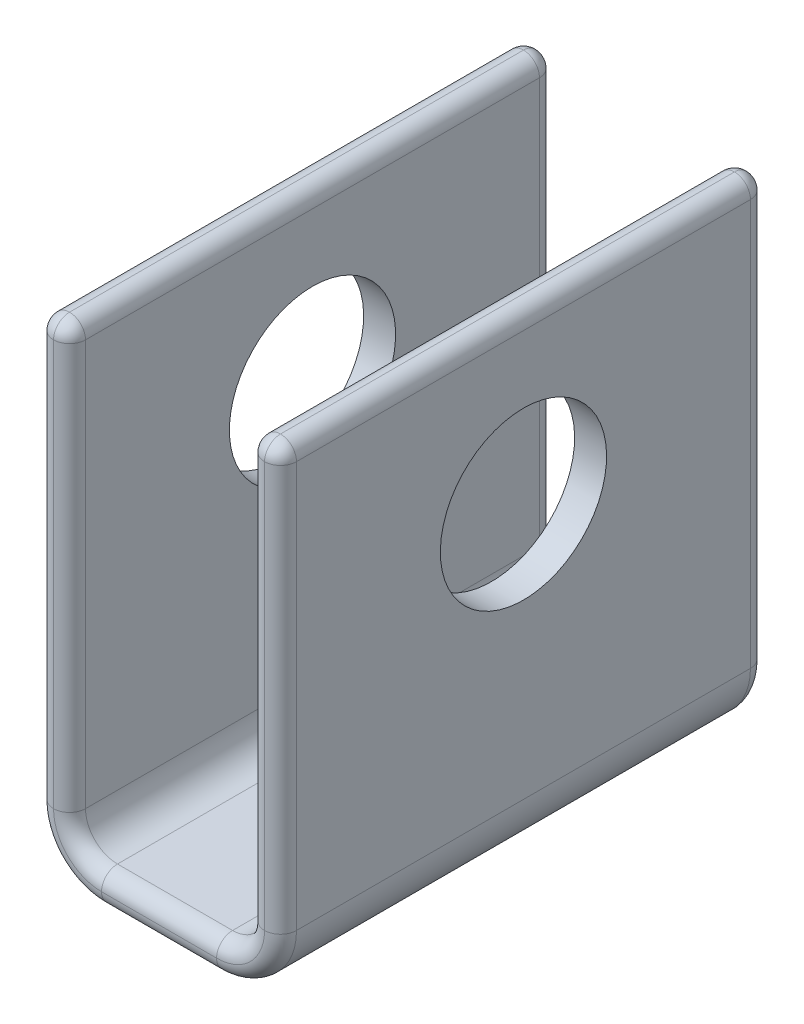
ISO-10303-21;
HEADER;
FILE_DESCRIPTION(('STEP AP214'),'2;1');
FILE_NAME('part.step','',(''),(''),'','','');
FILE_SCHEMA(('AUTOMOTIVE_DESIGN { 1 0 10303 214 1 1 1 1 }'));
ENDSEC;
DATA;
#1=APPLICATION_CONTEXT('core data for automotive mechanical design processes');
#2=APPLICATION_PROTOCOL_DEFINITION('international standard','automotive_design',2000,#1);
#3=PRODUCT_CONTEXT('',#1,'mechanical');
#4=PRODUCT('Part','Part','',(#3));
#5=PRODUCT_RELATED_PRODUCT_CATEGORY('part','',(#4));
#6=PRODUCT_DEFINITION_FORMATION('','',#4);
#7=PRODUCT_DEFINITION_CONTEXT('part definition',#1,'design');
#8=PRODUCT_DEFINITION('design','',#6,#7);
#9=PRODUCT_DEFINITION_SHAPE('','',#8);
#10=(LENGTH_UNIT() NAMED_UNIT(*) SI_UNIT(.MILLI.,.METRE.));
#11=(NAMED_UNIT(*) PLANE_ANGLE_UNIT() SI_UNIT($,.RADIAN.));
#12=(NAMED_UNIT(*) SI_UNIT($,.STERADIAN.) SOLID_ANGLE_UNIT());
#13=UNCERTAINTY_MEASURE_WITH_UNIT(LENGTH_MEASURE(1.E-05),#10,'distance_accuracy_value','');
#14=(GEOMETRIC_REPRESENTATION_CONTEXT(3) GLOBAL_UNCERTAINTY_ASSIGNED_CONTEXT((#13)) GLOBAL_UNIT_ASSIGNED_CONTEXT((#10,
#11,#12)) REPRESENTATION_CONTEXT('',''));
#15=CARTESIAN_POINT('',(0.,0.,0.));
#16=DIRECTION('',(0.,0.,1.));
#17=DIRECTION('',(1.,0.,0.));
#18=AXIS2_PLACEMENT_3D('',#15,#16,#17);
#19=CARTESIAN_POINT('',(-7.,5.,19.));
#20=DIRECTION('',(-1.,0.,0.));
#21=DIRECTION('',(0.,-1.,0.));
#22=AXIS2_PLACEMENT_3D('',#19,#20,#21);
#23=PLANE('',#22);
#24=CARTESIAN_POINT('',(-7.,25.,0.));
#25=DIRECTION('',(-1.,0.,0.));
#26=DIRECTION('',(0.,-1.,0.));
#27=AXIS2_PLACEMENT_3D('',#24,#25,#26);
#28=CIRCLE('',#27,6.5);
#29=CARTESIAN_POINT('',(-7.,18.5,0.));
#30=VERTEX_POINT('',#29);
#31=EDGE_CURVE('E271',#30,#30,#28,.T.);
#32=ORIENTED_EDGE('',*,*,#31,.T.);
#33=EDGE_LOOP('',(#32));
#34=FACE_BOUND('',#33,.T.);
#35=DIRECTION('',(0.,0.,-1.));
#36=VECTOR('',#35,1.);
#37=CARTESIAN_POINT('',(-7.,5.,19.));
#38=LINE('',#37,#36);
#39=CARTESIAN_POINT('',(-7.,5.,17.75));
#40=VERTEX_POINT('',#39);
#41=CARTESIAN_POINT('',(-7.,5.,-17.75));
#42=VERTEX_POINT('',#41);
#43=EDGE_CURVE('E258',#40,#42,#38,.T.);
#44=ORIENTED_EDGE('',*,*,#43,.T.);
#45=DIRECTION('',(0.,1.,0.));
#46=VECTOR('',#45,1.);
#47=CARTESIAN_POINT('',(-7.,38.,-17.75));
#48=LINE('',#47,#46);
#49=CARTESIAN_POINT('',(-7.,36.75,-17.75));
#50=VERTEX_POINT('',#49);
#51=EDGE_CURVE('E308',#42,#50,#48,.T.);
#52=ORIENTED_EDGE('',*,*,#51,.T.);
#53=DIRECTION('',(0.,0.,-1.));
#54=VECTOR('',#53,1.);
#55=CARTESIAN_POINT('',(-7.,36.75,19.));
#56=LINE('',#55,#54);
#57=CARTESIAN_POINT('',(-7.,36.75,17.75));
#58=VERTEX_POINT('',#57);
#59=EDGE_CURVE('E302',#50,#58,#56,.F.);
#60=ORIENTED_EDGE('',*,*,#59,.T.);
#61=DIRECTION('',(0.,1.,0.));
#62=VECTOR('',#61,1.);
#63=CARTESIAN_POINT('',(-7.,5.,17.75));
#64=LINE('',#63,#62);
#65=EDGE_CURVE('E305',#58,#40,#64,.F.);
#66=ORIENTED_EDGE('',*,*,#65,.T.);
#67=EDGE_LOOP('',(#44,#52,#60,#66));
#68=FACE_BOUND('',#67,.T.);
#69=ADVANCED_FACE('F39',(#34,#68),#23,.F.);
#70=CARTESIAN_POINT('',(-9.5,5.,19.));
#71=DIRECTION('',(-1.,0.,0.));
#72=DIRECTION('',(0.,-1.,0.));
#73=AXIS2_PLACEMENT_3D('',#70,#71,#72);
#74=PLANE('',#73);
#75=CARTESIAN_POINT('',(-9.50000000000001,25.,0.));
#76=DIRECTION('',(1.,0.,0.));
#77=DIRECTION('',(0.,1.,0.));
#78=AXIS2_PLACEMENT_3D('',#75,#76,#77);
#79=CIRCLE('',#78,6.5);
#80=CARTESIAN_POINT('',(-9.50000000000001,31.5,0.));
#81=VERTEX_POINT('',#80);
#82=EDGE_CURVE('E969',#81,#81,#79,.T.);
#83=ORIENTED_EDGE('',*,*,#82,.T.);
#84=EDGE_LOOP('',(#83));
#85=FACE_BOUND('',#84,.T.);
#86=DIRECTION('',(0.,0.,-1.));
#87=VECTOR('',#86,1.);
#88=CARTESIAN_POINT('',(-9.5,36.75,19.));
#89=LINE('',#88,#87);
#90=CARTESIAN_POINT('',(-9.5,36.75,17.75));
#91=VERTEX_POINT('',#90);
#92=CARTESIAN_POINT('',(-9.5,36.75,-17.75));
#93=VERTEX_POINT('',#92);
#94=EDGE_CURVE('E311',#91,#93,#89,.T.);
#95=ORIENTED_EDGE('',*,*,#94,.T.);
#96=DIRECTION('',(0.,1.,0.));
#97=VECTOR('',#96,1.);
#98=CARTESIAN_POINT('',(-9.5,5.,-17.75));
#99=LINE('',#98,#97);
#100=CARTESIAN_POINT('',(-9.5,5.,-17.75));
#101=VERTEX_POINT('',#100);
#102=EDGE_CURVE('E317',#93,#101,#99,.F.);
#103=ORIENTED_EDGE('',*,*,#102,.T.);
#104=DIRECTION('',(0.,0.,-1.));
#105=VECTOR('',#104,1.);
#106=CARTESIAN_POINT('',(-9.5,5.,19.));
#107=LINE('',#106,#105);
#108=CARTESIAN_POINT('',(-9.5,5.,17.75));
#109=VERTEX_POINT('',#108);
#110=EDGE_CURVE('E288',#109,#101,#107,.T.);
#111=ORIENTED_EDGE('',*,*,#110,.F.);
#112=DIRECTION('',(0.,1.,0.));
#113=VECTOR('',#112,1.);
#114=CARTESIAN_POINT('',(-9.5,38.,17.75));
#115=LINE('',#114,#113);
#116=EDGE_CURVE('E314',#109,#91,#115,.T.);
#117=ORIENTED_EDGE('',*,*,#116,.T.);
#118=EDGE_LOOP('',(#95,#103,#111,#117));
#119=FACE_BOUND('',#118,.T.);
#120=ADVANCED_FACE('F577',(#85,#119),#74,.T.);
#121=CARTESIAN_POINT('',(-4.5,5.,19.));
#122=DIRECTION('',(0.,0.,-1.));
#123=DIRECTION('',(-1.,0.,0.));
#124=AXIS2_PLACEMENT_3D('',#121,#122,#123);
#125=CYLINDRICAL_SURFACE('',#124,5.);
#126=ORIENTED_EDGE('',*,*,#110,.T.);
#127=CARTESIAN_POINT('',(-4.5,5.,-17.75));
#128=DIRECTION('',(0.,0.,-1.));
#129=DIRECTION('',(-1.,0.,0.));
#130=AXIS2_PLACEMENT_3D('',#127,#128,#129);
#131=CIRCLE('',#130,5.);
#132=CARTESIAN_POINT('',(-4.5,0.,-17.75));
#133=VERTEX_POINT('',#132);
#134=EDGE_CURVE('E323',#101,#133,#131,.F.);
#135=ORIENTED_EDGE('',*,*,#134,.T.);
#136=DIRECTION('',(0.,0.,-1.));
#137=VECTOR('',#136,1.);
#138=CARTESIAN_POINT('',(-4.5,0.,19.));
#139=LINE('',#138,#137);
#140=CARTESIAN_POINT('',(-4.5,0.,17.75));
#141=VERTEX_POINT('',#140);
#142=EDGE_CURVE('E284',#141,#133,#139,.T.);
#143=ORIENTED_EDGE('',*,*,#142,.F.);
#144=CARTESIAN_POINT('',(-4.5,5.,17.75));
#145=DIRECTION('',(0.,0.,-1.));
#146=DIRECTION('',(-1.,0.,0.));
#147=AXIS2_PLACEMENT_3D('',#144,#145,#146);
#148=CIRCLE('',#147,5.);
#149=EDGE_CURVE('E320',#141,#109,#148,.T.);
#150=ORIENTED_EDGE('',*,*,#149,.T.);
#151=EDGE_LOOP('',(#126,#135,#143,#150));
#152=FACE_BOUND('',#151,.T.);
#153=ADVANCED_FACE('F574',(#152),#125,.T.);
#154=CARTESIAN_POINT('',(-4.5,0.,19.));
#155=DIRECTION('',(0.,-1.,0.));
#156=DIRECTION('',(1.,0.,0.));
#157=AXIS2_PLACEMENT_3D('',#154,#155,#156);
#158=PLANE('',#157);
#159=ORIENTED_EDGE('',*,*,#142,.T.);
#160=DIRECTION('',(-1.,0.,0.));
#161=VECTOR('',#160,1.);
#162=CARTESIAN_POINT('',(-4.5,0.,-17.75));
#163=LINE('',#162,#161);
#164=CARTESIAN_POINT('',(4.5,0.,-17.75));
#165=VERTEX_POINT('',#164);
#166=EDGE_CURVE('E329',#133,#165,#163,.F.);
#167=ORIENTED_EDGE('',*,*,#166,.T.);
#168=DIRECTION('',(0.,0.,-1.));
#169=VECTOR('',#168,1.);
#170=CARTESIAN_POINT('',(4.5,0.,19.));
#171=LINE('',#170,#169);
#172=CARTESIAN_POINT('',(4.5,0.,17.75));
#173=VERTEX_POINT('',#172);
#174=EDGE_CURVE('E280',#173,#165,#171,.T.);
#175=ORIENTED_EDGE('',*,*,#174,.F.);
#176=DIRECTION('',(-1.,0.,0.));
#177=VECTOR('',#176,1.);
#178=CARTESIAN_POINT('',(-4.5,0.,17.75));
#179=LINE('',#178,#177);
#180=EDGE_CURVE('E326',#173,#141,#179,.T.);
#181=ORIENTED_EDGE('',*,*,#180,.T.);
#182=EDGE_LOOP('',(#159,#167,#175,#181));
#183=FACE_BOUND('',#182,.T.);
#184=ADVANCED_FACE('F564',(#183),#158,.T.);
#185=CARTESIAN_POINT('',(4.5,5.,19.));
#186=DIRECTION('',(0.,0.,-1.));
#187=DIRECTION('',(-1.,0.,0.));
#188=AXIS2_PLACEMENT_3D('',#185,#186,#187);
#189=CYLINDRICAL_SURFACE('',#188,5.);
#190=ORIENTED_EDGE('',*,*,#174,.T.);
#191=CARTESIAN_POINT('',(4.5,5.,-17.75));
#192=DIRECTION('',(0.,0.,-1.));
#193=DIRECTION('',(-1.,0.,0.));
#194=AXIS2_PLACEMENT_3D('',#191,#192,#193);
#195=CIRCLE('',#194,5.);
#196=CARTESIAN_POINT('',(9.49999999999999,5.,-17.75));
#197=VERTEX_POINT('',#196);
#198=EDGE_CURVE('E335',#165,#197,#195,.F.);
#199=ORIENTED_EDGE('',*,*,#198,.T.);
#200=DIRECTION('',(0.,0.,-1.));
#201=VECTOR('',#200,1.);
#202=CARTESIAN_POINT('',(9.49999999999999,5.,19.));
#203=LINE('',#202,#201);
#204=CARTESIAN_POINT('',(9.49999999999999,5.,17.75));
#205=VERTEX_POINT('',#204);
#206=EDGE_CURVE('E276',#205,#197,#203,.T.);
#207=ORIENTED_EDGE('',*,*,#206,.F.);
#208=CARTESIAN_POINT('',(4.5,5.,17.75));
#209=DIRECTION('',(0.,0.,-1.));
#210=DIRECTION('',(-1.,0.,0.));
#211=AXIS2_PLACEMENT_3D('',#208,#209,#210);
#212=CIRCLE('',#211,5.);
#213=EDGE_CURVE('E332',#205,#173,#212,.T.);
#214=ORIENTED_EDGE('',*,*,#213,.T.);
#215=EDGE_LOOP('',(#190,#199,#207,#214));
#216=FACE_BOUND('',#215,.T.);
#217=ADVANCED_FACE('F548',(#216),#189,.T.);
#218=CARTESIAN_POINT('',(9.49999999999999,5.,19.));
#219=DIRECTION('',(1.,0.,0.));
#220=DIRECTION('',(0.,1.,0.));
#221=AXIS2_PLACEMENT_3D('',#218,#219,#220);
#222=PLANE('',#221);
#223=CARTESIAN_POINT('',(9.49999999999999,25.,0.));
#224=DIRECTION('',(1.,0.,0.));
#225=DIRECTION('',(0.,1.,0.));
#226=AXIS2_PLACEMENT_3D('',#223,#224,#225);
#227=CIRCLE('',#226,6.5);
#228=CARTESIAN_POINT('',(9.49999999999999,31.5,0.));
#229=VERTEX_POINT('',#228);
#230=EDGE_CURVE('E967',#229,#229,#227,.T.);
#231=ORIENTED_EDGE('',*,*,#230,.F.);
#232=EDGE_LOOP('',(#231));
#233=FACE_BOUND('',#232,.T.);
#234=DIRECTION('',(0.,0.,-1.));
#235=VECTOR('',#234,1.);
#236=CARTESIAN_POINT('',(9.49999999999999,36.75,19.));
#237=LINE('',#236,#235);
#238=CARTESIAN_POINT('',(9.49999999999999,36.75,-17.75));
#239=VERTEX_POINT('',#238);
#240=CARTESIAN_POINT('',(9.49999999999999,36.75,17.75));
#241=VERTEX_POINT('',#240);
#242=EDGE_CURVE('E295',#239,#241,#237,.F.);
#243=ORIENTED_EDGE('',*,*,#242,.T.);
#244=DIRECTION('',(0.,-1.,0.));
#245=VECTOR('',#244,1.);
#246=CARTESIAN_POINT('',(9.49999999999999,5.,17.75));
#247=LINE('',#246,#245);
#248=EDGE_CURVE('E298',#241,#205,#247,.T.);
#249=ORIENTED_EDGE('',*,*,#248,.T.);
#250=ORIENTED_EDGE('',*,*,#206,.T.);
#251=DIRECTION('',(0.,-1.,0.));
#252=VECTOR('',#251,1.);
#253=CARTESIAN_POINT('',(9.49999999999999,5.,-17.75));
#254=LINE('',#253,#252);
#255=EDGE_CURVE('E292',#197,#239,#254,.F.);
#256=ORIENTED_EDGE('',*,*,#255,.T.);
#257=EDGE_LOOP('',(#243,#249,#250,#256));
#258=FACE_BOUND('',#257,.T.);
#259=ADVANCED_FACE('F551',(#233,#258),#222,.T.);
#260=CARTESIAN_POINT('',(6.99999999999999,5.,19.));
#261=DIRECTION('',(1.,0.,0.));
#262=DIRECTION('',(0.,1.,0.));
#263=AXIS2_PLACEMENT_3D('',#260,#261,#262);
#264=PLANE('',#263);
#265=CARTESIAN_POINT('',(6.99999999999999,25.,0.));
#266=DIRECTION('',(1.,0.,0.));
#267=DIRECTION('',(0.,1.,0.));
#268=AXIS2_PLACEMENT_3D('',#265,#266,#267);
#269=CIRCLE('',#268,6.5);
#270=CARTESIAN_POINT('',(6.99999999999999,31.5,0.));
#271=VERTEX_POINT('',#270);
#272=EDGE_CURVE('E43',#271,#271,#269,.T.);
#273=ORIENTED_EDGE('',*,*,#272,.T.);
#274=EDGE_LOOP('',(#273));
#275=FACE_BOUND('',#274,.T.);
#276=DIRECTION('',(0.,0.,-1.));
#277=VECTOR('',#276,1.);
#278=CARTESIAN_POINT('',(6.99999999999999,36.75,-19.));
#279=LINE('',#278,#277);
#280=CARTESIAN_POINT('',(6.99999999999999,36.75,17.75));
#281=VERTEX_POINT('',#280);
#282=CARTESIAN_POINT('',(6.99999999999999,36.75,-17.75));
#283=VERTEX_POINT('',#282);
#284=EDGE_CURVE('E338',#281,#283,#279,.T.);
#285=ORIENTED_EDGE('',*,*,#284,.T.);
#286=DIRECTION('',(0.,-1.,0.));
#287=VECTOR('',#286,1.);
#288=CARTESIAN_POINT('',(6.99999999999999,5.,-17.75));
#289=LINE('',#288,#287);
#290=CARTESIAN_POINT('',(6.99999999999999,5.,-17.75));
#291=VERTEX_POINT('',#290);
#292=EDGE_CURVE('E344',#283,#291,#289,.T.);
#293=ORIENTED_EDGE('',*,*,#292,.T.);
#294=DIRECTION('',(0.,0.,-1.));
#295=VECTOR('',#294,1.);
#296=CARTESIAN_POINT('',(6.99999999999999,5.,19.));
#297=LINE('',#296,#295);
#298=CARTESIAN_POINT('',(6.99999999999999,5.,17.75));
#299=VERTEX_POINT('',#298);
#300=EDGE_CURVE('E196',#299,#291,#297,.T.);
#301=ORIENTED_EDGE('',*,*,#300,.F.);
#302=DIRECTION('',(0.,-1.,0.));
#303=VECTOR('',#302,1.);
#304=CARTESIAN_POINT('',(6.99999999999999,5.,17.75));
#305=LINE('',#304,#303);
#306=EDGE_CURVE('E341',#299,#281,#305,.F.);
#307=ORIENTED_EDGE('',*,*,#306,.T.);
#308=EDGE_LOOP('',(#285,#293,#301,#307));
#309=FACE_BOUND('',#308,.T.);
#310=ADVANCED_FACE('F518',(#275,#309),#264,.F.);
#311=CARTESIAN_POINT('',(4.5,5.,19.));
#312=DIRECTION('',(0.,0.,-1.));
#313=DIRECTION('',(-1.,0.,0.));
#314=AXIS2_PLACEMENT_3D('',#311,#312,#313);
#315=CYLINDRICAL_SURFACE('',#314,2.5);
#316=ORIENTED_EDGE('',*,*,#300,.T.);
#317=CARTESIAN_POINT('',(4.5,5.,-17.75));
#318=DIRECTION('',(0.,0.,-1.));
#319=DIRECTION('',(-1.,0.,0.));
#320=AXIS2_PLACEMENT_3D('',#317,#318,#319);
#321=CIRCLE('',#320,2.5);
#322=CARTESIAN_POINT('',(4.5,2.5,-17.75));
#323=VERTEX_POINT('',#322);
#324=EDGE_CURVE('E191',#291,#323,#321,.T.);
#325=ORIENTED_EDGE('',*,*,#324,.T.);
#326=DIRECTION('',(0.,0.,-1.));
#327=VECTOR('',#326,1.);
#328=CARTESIAN_POINT('',(4.5,2.5,19.));
#329=LINE('',#328,#327);
#330=CARTESIAN_POINT('',(4.5,2.5,17.75));
#331=VERTEX_POINT('',#330);
#332=EDGE_CURVE('E193',#331,#323,#329,.T.);
#333=ORIENTED_EDGE('',*,*,#332,.F.);
#334=CARTESIAN_POINT('',(4.5,5.,17.75));
#335=DIRECTION('',(0.,0.,-1.));
#336=DIRECTION('',(-1.,0.,0.));
#337=AXIS2_PLACEMENT_3D('',#334,#335,#336);
#338=CIRCLE('',#337,2.5);
#339=EDGE_CURVE('E202',#331,#299,#338,.F.);
#340=ORIENTED_EDGE('',*,*,#339,.T.);
#341=EDGE_LOOP('',(#316,#325,#333,#340));
#342=FACE_BOUND('',#341,.T.);
#343=ADVANCED_FACE('F192',(#342),#315,.F.);
#344=CARTESIAN_POINT('',(-4.5,2.5,19.));
#345=DIRECTION('',(0.,-1.,0.));
#346=DIRECTION('',(1.,0.,0.));
#347=AXIS2_PLACEMENT_3D('',#344,#345,#346);
#348=PLANE('',#347);
#349=ORIENTED_EDGE('',*,*,#332,.T.);
#350=DIRECTION('',(-1.,0.,0.));
#351=VECTOR('',#350,1.);
#352=CARTESIAN_POINT('',(-4.5,2.5,-17.75));
#353=LINE('',#352,#351);
#354=CARTESIAN_POINT('',(-4.5,2.5,-17.75));
#355=VERTEX_POINT('',#354);
#356=EDGE_CURVE('E59',#323,#355,#353,.T.);
#357=ORIENTED_EDGE('',*,*,#356,.T.);
#358=DIRECTION('',(0.,0.,-1.));
#359=VECTOR('',#358,1.);
#360=CARTESIAN_POINT('',(-4.5,2.5,19.));
#361=LINE('',#360,#359);
#362=CARTESIAN_POINT('',(-4.5,2.5,17.75));
#363=VERTEX_POINT('',#362);
#364=EDGE_CURVE('E207',#363,#355,#361,.T.);
#365=ORIENTED_EDGE('',*,*,#364,.F.);
#366=DIRECTION('',(-1.,0.,0.));
#367=VECTOR('',#366,1.);
#368=CARTESIAN_POINT('',(-4.5,2.5,17.75));
#369=LINE('',#368,#367);
#370=EDGE_CURVE('E201',#363,#331,#369,.F.);
#371=ORIENTED_EDGE('',*,*,#370,.T.);
#372=EDGE_LOOP('',(#349,#357,#365,#371));
#373=FACE_BOUND('',#372,.T.);
#374=ADVANCED_FACE('F204',(#373),#348,.F.);
#375=CARTESIAN_POINT('',(-4.5,5.,19.));
#376=DIRECTION('',(0.,0.,-1.));
#377=DIRECTION('',(-1.,0.,0.));
#378=AXIS2_PLACEMENT_3D('',#375,#376,#377);
#379=CYLINDRICAL_SURFACE('',#378,2.5);
#380=ORIENTED_EDGE('',*,*,#364,.T.);
#381=CARTESIAN_POINT('',(-4.5,5.,-17.75));
#382=DIRECTION('',(0.,0.,-1.));
#383=DIRECTION('',(-1.,0.,0.));
#384=AXIS2_PLACEMENT_3D('',#381,#382,#383);
#385=CIRCLE('',#384,2.5);
#386=EDGE_CURVE('E11',#355,#42,#385,.T.);
#387=ORIENTED_EDGE('',*,*,#386,.T.);
#388=ORIENTED_EDGE('',*,*,#43,.F.);
#389=CARTESIAN_POINT('',(-4.5,5.,17.75));
#390=DIRECTION('',(0.,0.,-1.));
#391=DIRECTION('',(-1.,0.,0.));
#392=AXIS2_PLACEMENT_3D('',#389,#390,#391);
#393=CIRCLE('',#392,2.5);
#394=EDGE_CURVE('E50',#40,#363,#393,.F.);
#395=ORIENTED_EDGE('',*,*,#394,.T.);
#396=EDGE_LOOP('',(#380,#387,#388,#395));
#397=FACE_BOUND('',#396,.T.);
#398=ADVANCED_FACE('F501',(#397),#379,.F.);
#399=CARTESIAN_POINT('',(-8.25,5.,-17.75));
#400=DIRECTION('',(0.,-1.,0.));
#401=DIRECTION('',(1.,0.,0.));
#402=AXIS2_PLACEMENT_3D('',#399,#400,#401);
#403=CYLINDRICAL_SURFACE('',#402,1.25);
#404=CARTESIAN_POINT('',(-8.25,36.75,-17.75));
#405=DIRECTION('',(0.,1.,0.));
#406=DIRECTION('',(0.,0.,1.));
#407=AXIS2_PLACEMENT_3D('',#404,#405,#406);
#408=CIRCLE('',#407,1.25);
#409=CARTESIAN_POINT('',(-8.25,36.75,-19.));
#410=VERTEX_POINT('',#409);
#411=EDGE_CURVE('E252',#50,#410,#408,.T.);
#412=ORIENTED_EDGE('',*,*,#411,.F.);
#413=ORIENTED_EDGE('',*,*,#51,.F.);
#414=CARTESIAN_POINT('',(-8.25,5.,-17.75));
#415=DIRECTION('',(0.,-1.,0.));
#416=DIRECTION('',(0.,0.,-1.));
#417=AXIS2_PLACEMENT_3D('',#414,#415,#416);
#418=CIRCLE('',#417,1.25);
#419=CARTESIAN_POINT('',(-8.25,5.,-19.));
#420=VERTEX_POINT('',#419);
#421=EDGE_CURVE('E113',#420,#42,#418,.T.);
#422=ORIENTED_EDGE('',*,*,#421,.F.);
#423=DIRECTION('',(0.,1.,0.));
#424=VECTOR('',#423,1.);
#425=CARTESIAN_POINT('',(-8.25,5.,-19.));
#426=LINE('',#425,#424);
#427=EDGE_CURVE('E117',#410,#420,#426,.F.);
#428=ORIENTED_EDGE('',*,*,#427,.F.);
#429=EDGE_LOOP('',(#412,#413,#422,#428));
#430=FACE_BOUND('',#429,.T.);
#431=ADVANCED_FACE('F41',(#430),#403,.T.);
#432=CARTESIAN_POINT('',(-4.5,5.,-17.75));
#433=DIRECTION('',(0.,0.,-1.));
#434=DIRECTION('',(-1.,0.,0.));
#435=AXIS2_PLACEMENT_3D('',#432,#433,#434);
#436=TOROIDAL_SURFACE('',#435,3.75,1.25);
#437=ORIENTED_EDGE('',*,*,#421,.T.);
#438=ORIENTED_EDGE('',*,*,#386,.F.);
#439=CARTESIAN_POINT('',(-4.5,1.25,-17.75));
#440=DIRECTION('',(1.,0.,0.));
#441=DIRECTION('',(0.,0.,-1.));
#442=AXIS2_PLACEMENT_3D('',#439,#440,#441);
#443=CIRCLE('',#442,1.25);
#444=CARTESIAN_POINT('',(-4.5,1.25,-19.));
#445=VERTEX_POINT('',#444);
#446=EDGE_CURVE('E215',#445,#355,#443,.T.);
#447=ORIENTED_EDGE('',*,*,#446,.F.);
#448=CARTESIAN_POINT('',(-4.5,5.,-19.));
#449=DIRECTION('',(0.,0.,-1.));
#450=DIRECTION('',(-1.,0.,0.));
#451=AXIS2_PLACEMENT_3D('',#448,#449,#450);
#452=CIRCLE('',#451,3.75);
#453=EDGE_CURVE('E246',#420,#445,#452,.F.);
#454=ORIENTED_EDGE('',*,*,#453,.F.);
#455=EDGE_LOOP('',(#437,#438,#447,#454));
#456=FACE_BOUND('',#455,.T.);
#457=ADVANCED_FACE('F499',(#456),#436,.T.);
#458=CARTESIAN_POINT('',(-8.25,5.,-17.75));
#459=DIRECTION('',(0.,1.,0.));
#460=DIRECTION('',(-1.,0.,0.));
#461=AXIS2_PLACEMENT_3D('',#458,#459,#460);
#462=CYLINDRICAL_SURFACE('',#461,1.25);
#463=CARTESIAN_POINT('',(-8.25,36.75,-17.75));
#464=DIRECTION('',(0.,1.,0.));
#465=DIRECTION('',(0.,0.,1.));
#466=AXIS2_PLACEMENT_3D('',#463,#464,#465);
#467=CIRCLE('',#466,1.25);
#468=EDGE_CURVE('E238',#410,#93,#467,.T.);
#469=ORIENTED_EDGE('',*,*,#468,.F.);
#470=ORIENTED_EDGE('',*,*,#427,.T.);
#471=CARTESIAN_POINT('',(-8.25,5.,-17.75));
#472=DIRECTION('',(0.,-1.,0.));
#473=DIRECTION('',(0.,0.,-1.));
#474=AXIS2_PLACEMENT_3D('',#471,#472,#473);
#475=CIRCLE('',#474,1.25);
#476=EDGE_CURVE('E242',#101,#420,#475,.T.);
#477=ORIENTED_EDGE('',*,*,#476,.F.);
#478=ORIENTED_EDGE('',*,*,#102,.F.);
#479=EDGE_LOOP('',(#469,#470,#477,#478));
#480=FACE_BOUND('',#479,.T.);
#481=ADVANCED_FACE('F602',(#480),#462,.T.);
#482=CARTESIAN_POINT('',(-8.25,36.75,-17.75));
#483=DIRECTION('',(0.,0.,1.));
#484=DIRECTION('',(1.,0.,0.));
#485=AXIS2_PLACEMENT_3D('',#482,#483,#484);
#486=SPHERICAL_SURFACE('',#485,1.25);
#487=ORIENTED_EDGE('',*,*,#411,.T.);
#488=CARTESIAN_POINT('',(-8.25,36.75,-17.75));
#489=DIRECTION('',(-1.,0.,0.));
#490=DIRECTION('',(0.,0.,1.));
#491=AXIS2_PLACEMENT_3D('',#488,#489,#490);
#492=CIRCLE('',#491,1.25);
#493=CARTESIAN_POINT('',(-8.25,38.,-17.75));
#494=VERTEX_POINT('',#493);
#495=EDGE_CURVE('E230',#494,#410,#492,.T.);
#496=ORIENTED_EDGE('',*,*,#495,.F.);
#497=CARTESIAN_POINT('',(-8.25,36.75,-17.75));
#498=DIRECTION('',(0.,0.,-1.));
#499=DIRECTION('',(-1.,0.,0.));
#500=AXIS2_PLACEMENT_3D('',#497,#498,#499);
#501=CIRCLE('',#500,1.25);
#502=EDGE_CURVE('E224',#50,#494,#501,.F.);
#503=ORIENTED_EDGE('',*,*,#502,.F.);
#504=EDGE_LOOP('',(#487,#496,#503));
#505=FACE_BOUND('',#504,.T.);
#506=ADVANCED_FACE('F603',(#505),#486,.T.);
#507=CARTESIAN_POINT('',(-4.5,1.25,-17.75));
#508=DIRECTION('',(1.,0.,0.));
#509=DIRECTION('',(0.,1.,0.));
#510=AXIS2_PLACEMENT_3D('',#507,#508,#509);
#511=CYLINDRICAL_SURFACE('',#510,1.25);
#512=ORIENTED_EDGE('',*,*,#446,.T.);
#513=ORIENTED_EDGE('',*,*,#356,.F.);
#514=CARTESIAN_POINT('',(4.49999999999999,1.25,-17.75));
#515=DIRECTION('',(1.,0.,0.));
#516=DIRECTION('',(0.,1.,0.));
#517=AXIS2_PLACEMENT_3D('',#514,#515,#516);
#518=CIRCLE('',#517,1.25);
#519=CARTESIAN_POINT('',(4.5,1.25,-19.));
#520=VERTEX_POINT('',#519);
#521=EDGE_CURVE('E213',#520,#323,#518,.T.);
#522=ORIENTED_EDGE('',*,*,#521,.F.);
#523=DIRECTION('',(-1.,0.,0.));
#524=VECTOR('',#523,1.);
#525=CARTESIAN_POINT('',(4.5,1.25,-19.));
#526=LINE('',#525,#524);
#527=EDGE_CURVE('E225',#445,#520,#526,.F.);
#528=ORIENTED_EDGE('',*,*,#527,.F.);
#529=EDGE_LOOP('',(#512,#513,#522,#528));
#530=FACE_BOUND('',#529,.T.);
#531=ADVANCED_FACE('F211',(#530),#511,.T.);
#532=CARTESIAN_POINT('',(-4.5,5.,-17.75));
#533=DIRECTION('',(0.,0.,-1.));
#534=DIRECTION('',(-1.,0.,0.));
#535=AXIS2_PLACEMENT_3D('',#532,#533,#534);
#536=TOROIDAL_SURFACE('',#535,3.75,1.25);
#537=ORIENTED_EDGE('',*,*,#476,.T.);
#538=ORIENTED_EDGE('',*,*,#453,.T.);
#539=CARTESIAN_POINT('',(-4.5,1.25,-17.75));
#540=DIRECTION('',(1.,0.,0.));
#541=DIRECTION('',(0.,0.,-1.));
#542=AXIS2_PLACEMENT_3D('',#539,#540,#541);
#543=CIRCLE('',#542,1.25);
#544=EDGE_CURVE('E232',#133,#445,#543,.T.);
#545=ORIENTED_EDGE('',*,*,#544,.F.);
#546=ORIENTED_EDGE('',*,*,#134,.F.);
#547=EDGE_LOOP('',(#537,#538,#545,#546));
#548=FACE_BOUND('',#547,.T.);
#549=ADVANCED_FACE('F497',(#548),#536,.T.);
#550=CARTESIAN_POINT('',(-8.25,36.75,-17.75));
#551=DIRECTION('',(0.,0.,1.));
#552=DIRECTION('',(1.,0.,0.));
#553=AXIS2_PLACEMENT_3D('',#550,#551,#552);
#554=SPHERICAL_SURFACE('',#553,1.25);
#555=ORIENTED_EDGE('',*,*,#495,.T.);
#556=ORIENTED_EDGE('',*,*,#468,.T.);
#557=CARTESIAN_POINT('',(-8.25,36.75,-17.75));
#558=DIRECTION('',(0.,0.,-1.));
#559=DIRECTION('',(-1.,0.,0.));
#560=AXIS2_PLACEMENT_3D('',#557,#558,#559);
#561=CIRCLE('',#560,1.25);
#562=EDGE_CURVE('E485',#494,#93,#561,.F.);
#563=ORIENTED_EDGE('',*,*,#562,.F.);
#564=EDGE_LOOP('',(#555,#556,#563));
#565=FACE_BOUND('',#564,.T.);
#566=ADVANCED_FACE('F599',(#565),#554,.T.);
#567=CARTESIAN_POINT('',(-8.25,36.75,19.));
#568=DIRECTION('',(0.,0.,1.));
#569=DIRECTION('',(1.,0.,0.));
#570=AXIS2_PLACEMENT_3D('',#567,#568,#569);
#571=CYLINDRICAL_SURFACE('',#570,1.25);
#572=ORIENTED_EDGE('',*,*,#59,.F.);
#573=ORIENTED_EDGE('',*,*,#502,.T.);
#574=DIRECTION('',(0.,0.,-1.));
#575=VECTOR('',#574,1.);
#576=CARTESIAN_POINT('',(-8.25,38.,-19.));
#577=LINE('',#576,#575);
#578=CARTESIAN_POINT('',(-8.25,38.,17.75));
#579=VERTEX_POINT('',#578);
#580=EDGE_CURVE('E481',#579,#494,#577,.T.);
#581=ORIENTED_EDGE('',*,*,#580,.F.);
#582=CARTESIAN_POINT('',(-8.25,36.75,17.75));
#583=DIRECTION('',(0.,0.,1.));
#584=DIRECTION('',(1.,0.,0.));
#585=AXIS2_PLACEMENT_3D('',#582,#583,#584);
#586=CIRCLE('',#585,1.25);
#587=EDGE_CURVE('E477',#58,#579,#586,.T.);
#588=ORIENTED_EDGE('',*,*,#587,.F.);
#589=EDGE_LOOP('',(#572,#573,#581,#588));
#590=FACE_BOUND('',#589,.T.);
#591=ADVANCED_FACE('F594',(#590),#571,.T.);
#592=CARTESIAN_POINT('',(4.5,5.,-17.75));
#593=DIRECTION('',(0.,0.,-1.));
#594=DIRECTION('',(-1.,0.,0.));
#595=AXIS2_PLACEMENT_3D('',#592,#593,#594);
#596=TOROIDAL_SURFACE('',#595,3.75,1.25);
#597=ORIENTED_EDGE('',*,*,#521,.T.);
#598=ORIENTED_EDGE('',*,*,#324,.F.);
#599=CARTESIAN_POINT('',(8.24999999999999,5.,-17.75));
#600=DIRECTION('',(0.,1.,0.));
#601=DIRECTION('',(0.,0.,1.));
#602=AXIS2_PLACEMENT_3D('',#599,#600,#601);
#603=CIRCLE('',#602,1.25);
#604=CARTESIAN_POINT('',(8.25,5.,-19.));
#605=VERTEX_POINT('',#604);
#606=EDGE_CURVE('E474',#605,#291,#603,.T.);
#607=ORIENTED_EDGE('',*,*,#606,.F.);
#608=CARTESIAN_POINT('',(4.5,5.,-19.));
#609=DIRECTION('',(0.,0.,-1.));
#610=DIRECTION('',(-1.,0.,0.));
#611=AXIS2_PLACEMENT_3D('',#608,#609,#610);
#612=CIRCLE('',#611,3.75);
#613=EDGE_CURVE('E221',#520,#605,#612,.F.);
#614=ORIENTED_EDGE('',*,*,#613,.F.);
#615=EDGE_LOOP('',(#597,#598,#607,#614));
#616=FACE_BOUND('',#615,.T.);
#617=ADVANCED_FACE('F219',(#616),#596,.T.);
#618=CARTESIAN_POINT('',(-4.5,1.25,-17.75));
#619=DIRECTION('',(-1.,0.,0.));
#620=DIRECTION('',(0.,-1.,0.));
#621=AXIS2_PLACEMENT_3D('',#618,#619,#620);
#622=CYLINDRICAL_SURFACE('',#621,1.25);
#623=ORIENTED_EDGE('',*,*,#544,.T.);
#624=ORIENTED_EDGE('',*,*,#527,.T.);
#625=CARTESIAN_POINT('',(4.5,1.25,-17.75));
#626=DIRECTION('',(1.,0.,0.));
#627=DIRECTION('',(0.,0.,-1.));
#628=AXIS2_PLACEMENT_3D('',#625,#626,#627);
#629=CIRCLE('',#628,1.25);
#630=EDGE_CURVE('E469',#165,#520,#629,.T.);
#631=ORIENTED_EDGE('',*,*,#630,.F.);
#632=ORIENTED_EDGE('',*,*,#166,.F.);
#633=EDGE_LOOP('',(#623,#624,#631,#632));
#634=FACE_BOUND('',#633,.T.);
#635=ADVANCED_FACE('F493',(#634),#622,.T.);
#636=CARTESIAN_POINT('',(-8.25,36.75,19.));
#637=DIRECTION('',(0.,0.,-1.));
#638=DIRECTION('',(-1.,0.,0.));
#639=AXIS2_PLACEMENT_3D('',#636,#637,#638);
#640=CYLINDRICAL_SURFACE('',#639,1.25);
#641=CARTESIAN_POINT('',(-8.25,36.75,17.75));
#642=DIRECTION('',(0.,0.,1.));
#643=DIRECTION('',(1.,0.,0.));
#644=AXIS2_PLACEMENT_3D('',#641,#642,#643);
#645=CIRCLE('',#644,1.25);
#646=EDGE_CURVE('E465',#579,#91,#645,.T.);
#647=ORIENTED_EDGE('',*,*,#646,.F.);
#648=ORIENTED_EDGE('',*,*,#580,.T.);
#649=ORIENTED_EDGE('',*,*,#562,.T.);
#650=ORIENTED_EDGE('',*,*,#94,.F.);
#651=EDGE_LOOP('',(#647,#648,#649,#650));
#652=FACE_BOUND('',#651,.T.);
#653=ADVANCED_FACE('F587',(#652),#640,.T.);
#654=CARTESIAN_POINT('',(-8.25,36.75,17.75));
#655=DIRECTION('',(0.,0.,1.));
#656=DIRECTION('',(1.,0.,0.));
#657=AXIS2_PLACEMENT_3D('',#654,#655,#656);
#658=SPHERICAL_SURFACE('',#657,1.25);
#659=ORIENTED_EDGE('',*,*,#587,.T.);
#660=CARTESIAN_POINT('',(-8.25,36.75,17.75));
#661=DIRECTION('',(-1.,0.,0.));
#662=DIRECTION('',(0.,0.,1.));
#663=AXIS2_PLACEMENT_3D('',#660,#661,#662);
#664=CIRCLE('',#663,1.25);
#665=CARTESIAN_POINT('',(-8.25,36.75,19.));
#666=VERTEX_POINT('',#665);
#667=EDGE_CURVE('E461',#666,#579,#664,.T.);
#668=ORIENTED_EDGE('',*,*,#667,.F.);
#669=CARTESIAN_POINT('',(-8.25,36.75,17.75));
#670=DIRECTION('',(0.,1.,0.));
#671=DIRECTION('',(0.,0.,1.));
#672=AXIS2_PLACEMENT_3D('',#669,#670,#671);
#673=CIRCLE('',#672,1.25);
#674=EDGE_CURVE('E457',#58,#666,#673,.F.);
#675=ORIENTED_EDGE('',*,*,#674,.F.);
#676=EDGE_LOOP('',(#659,#668,#675));
#677=FACE_BOUND('',#676,.T.);
#678=ADVANCED_FACE('F591',(#677),#658,.T.);
#679=CARTESIAN_POINT('',(8.24999999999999,5.,-17.75));
#680=DIRECTION('',(0.,1.,0.));
#681=DIRECTION('',(-1.,0.,0.));
#682=AXIS2_PLACEMENT_3D('',#679,#680,#681);
#683=CYLINDRICAL_SURFACE('',#682,1.25);
#684=ORIENTED_EDGE('',*,*,#606,.T.);
#685=ORIENTED_EDGE('',*,*,#292,.F.);
#686=CARTESIAN_POINT('',(8.24999999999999,36.75,-17.75));
#687=DIRECTION('',(0.,1.,0.));
#688=DIRECTION('',(0.,0.,1.));
#689=AXIS2_PLACEMENT_3D('',#686,#687,#688);
#690=CIRCLE('',#689,1.25);
#691=CARTESIAN_POINT('',(8.24999999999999,36.75,-19.));
#692=VERTEX_POINT('',#691);
#693=EDGE_CURVE('E453',#692,#283,#690,.T.);
#694=ORIENTED_EDGE('',*,*,#693,.F.);
#695=DIRECTION('',(0.,-1.,0.));
#696=VECTOR('',#695,1.);
#697=CARTESIAN_POINT('',(8.24999999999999,38.,-19.));
#698=LINE('',#697,#696);
#699=EDGE_CURVE('E445',#605,#692,#698,.F.);
#700=ORIENTED_EDGE('',*,*,#699,.F.);
#701=EDGE_LOOP('',(#684,#685,#694,#700));
#702=FACE_BOUND('',#701,.T.);
#703=ADVANCED_FACE('F522',(#702),#683,.T.);
#704=CARTESIAN_POINT('',(4.5,5.,-17.75));
#705=DIRECTION('',(0.,0.,-1.));
#706=DIRECTION('',(-1.,0.,0.));
#707=AXIS2_PLACEMENT_3D('',#704,#705,#706);
#708=TOROIDAL_SURFACE('',#707,3.75,1.25);
#709=ORIENTED_EDGE('',*,*,#630,.T.);
#710=ORIENTED_EDGE('',*,*,#613,.T.);
#711=CARTESIAN_POINT('',(8.24999999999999,5.,-17.75));
#712=DIRECTION('',(0.,1.,0.));
#713=DIRECTION('',(0.,0.,1.));
#714=AXIS2_PLACEMENT_3D('',#711,#712,#713);
#715=CIRCLE('',#714,1.25);
#716=EDGE_CURVE('E441',#197,#605,#715,.T.);
#717=ORIENTED_EDGE('',*,*,#716,.F.);
#718=ORIENTED_EDGE('',*,*,#198,.F.);
#719=EDGE_LOOP('',(#709,#710,#717,#718));
#720=FACE_BOUND('',#719,.T.);
#721=ADVANCED_FACE('F545',(#720),#708,.T.);
#722=CARTESIAN_POINT('',(-8.25,36.75,17.75));
#723=DIRECTION('',(0.,0.,1.));
#724=DIRECTION('',(1.,0.,0.));
#725=AXIS2_PLACEMENT_3D('',#722,#723,#724);
#726=SPHERICAL_SURFACE('',#725,1.25);
#727=ORIENTED_EDGE('',*,*,#667,.T.);
#728=ORIENTED_EDGE('',*,*,#646,.T.);
#729=CARTESIAN_POINT('',(-8.25,36.75,17.75));
#730=DIRECTION('',(0.,1.,0.));
#731=DIRECTION('',(0.,0.,1.));
#732=AXIS2_PLACEMENT_3D('',#729,#730,#731);
#733=CIRCLE('',#732,1.25);
#734=EDGE_CURVE('E437',#666,#91,#733,.F.);
#735=ORIENTED_EDGE('',*,*,#734,.F.);
#736=EDGE_LOOP('',(#727,#728,#735));
#737=FACE_BOUND('',#736,.T.);
#738=ADVANCED_FACE('F584',(#737),#726,.T.);
#739=CARTESIAN_POINT('',(-8.25,5.,17.75));
#740=DIRECTION('',(0.,1.,0.));
#741=DIRECTION('',(-1.,0.,0.));
#742=AXIS2_PLACEMENT_3D('',#739,#740,#741);
#743=CYLINDRICAL_SURFACE('',#742,1.25);
#744=ORIENTED_EDGE('',*,*,#65,.F.);
#745=ORIENTED_EDGE('',*,*,#674,.T.);
#746=DIRECTION('',(0.,1.,0.));
#747=VECTOR('',#746,1.);
#748=CARTESIAN_POINT('',(-8.25,5.,19.));
#749=LINE('',#748,#747);
#750=CARTESIAN_POINT('',(-8.25,5.,19.));
#751=VERTEX_POINT('',#750);
#752=EDGE_CURVE('E433',#751,#666,#749,.T.);
#753=ORIENTED_EDGE('',*,*,#752,.F.);
#754=CARTESIAN_POINT('',(-8.25,5.,17.75));
#755=DIRECTION('',(0.,-1.,0.));
#756=DIRECTION('',(0.,0.,-1.));
#757=AXIS2_PLACEMENT_3D('',#754,#755,#756);
#758=CIRCLE('',#757,1.25);
#759=EDGE_CURVE('E429',#40,#751,#758,.T.);
#760=ORIENTED_EDGE('',*,*,#759,.F.);
#761=EDGE_LOOP('',(#744,#745,#753,#760));
#762=FACE_BOUND('',#761,.T.);
#763=ADVANCED_FACE('F605',(#762),#743,.T.);
#764=CARTESIAN_POINT('',(8.24999999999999,36.75,-17.75));
#765=DIRECTION('',(0.,0.,1.));
#766=DIRECTION('',(1.,0.,0.));
#767=AXIS2_PLACEMENT_3D('',#764,#765,#766);
#768=SPHERICAL_SURFACE('',#767,1.25);
#769=CARTESIAN_POINT('',(8.24999999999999,36.75,-17.75));
#770=DIRECTION('',(-1.,0.,0.));
#771=DIRECTION('',(0.,0.,1.));
#772=AXIS2_PLACEMENT_3D('',#769,#770,#771);
#773=CIRCLE('',#772,1.25);
#774=CARTESIAN_POINT('',(8.24999999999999,38.,-17.75));
#775=VERTEX_POINT('',#774);
#776=EDGE_CURVE('E449',#692,#775,#773,.F.);
#777=ORIENTED_EDGE('',*,*,#776,.F.);
#778=ORIENTED_EDGE('',*,*,#693,.T.);
#779=CARTESIAN_POINT('',(8.24999999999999,36.75,-17.75));
#780=DIRECTION('',(0.,0.,-1.));
#781=DIRECTION('',(-1.,0.,0.));
#782=AXIS2_PLACEMENT_3D('',#779,#780,#781);
#783=CIRCLE('',#782,1.25);
#784=EDGE_CURVE('E425',#775,#283,#783,.F.);
#785=ORIENTED_EDGE('',*,*,#784,.F.);
#786=EDGE_LOOP('',(#777,#778,#785));
#787=FACE_BOUND('',#786,.T.);
#788=ADVANCED_FACE('F526',(#787),#768,.T.);
#789=CARTESIAN_POINT('',(8.25,5.,-17.75));
#790=DIRECTION('',(0.,-1.,0.));
#791=DIRECTION('',(1.,0.,0.));
#792=AXIS2_PLACEMENT_3D('',#789,#790,#791);
#793=CYLINDRICAL_SURFACE('',#792,1.25);
#794=ORIENTED_EDGE('',*,*,#716,.T.);
#795=ORIENTED_EDGE('',*,*,#699,.T.);
#796=CARTESIAN_POINT('',(8.24999999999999,36.75,-17.75));
#797=DIRECTION('',(0.,1.,0.));
#798=DIRECTION('',(0.,0.,1.));
#799=AXIS2_PLACEMENT_3D('',#796,#797,#798);
#800=CIRCLE('',#799,1.25);
#801=EDGE_CURVE('E421',#239,#692,#800,.T.);
#802=ORIENTED_EDGE('',*,*,#801,.F.);
#803=ORIENTED_EDGE('',*,*,#255,.F.);
#804=EDGE_LOOP('',(#794,#795,#802,#803));
#805=FACE_BOUND('',#804,.T.);
#806=ADVANCED_FACE('F541',(#805),#793,.T.);
#807=CARTESIAN_POINT('',(-8.25,5.,17.75));
#808=DIRECTION('',(0.,-1.,0.));
#809=DIRECTION('',(1.,0.,0.));
#810=AXIS2_PLACEMENT_3D('',#807,#808,#809);
#811=CYLINDRICAL_SURFACE('',#810,1.25);
#812=ORIENTED_EDGE('',*,*,#734,.T.);
#813=ORIENTED_EDGE('',*,*,#116,.F.);
#814=CARTESIAN_POINT('',(-8.25,5.,17.75));
#815=DIRECTION('',(0.,-1.,0.));
#816=DIRECTION('',(0.,0.,-1.));
#817=AXIS2_PLACEMENT_3D('',#814,#815,#816);
#818=CIRCLE('',#817,1.25);
#819=EDGE_CURVE('E417',#751,#109,#818,.T.);
#820=ORIENTED_EDGE('',*,*,#819,.F.);
#821=ORIENTED_EDGE('',*,*,#752,.T.);
#822=EDGE_LOOP('',(#812,#813,#820,#821));
#823=FACE_BOUND('',#822,.T.);
#824=ADVANCED_FACE('F581',(#823),#811,.T.);
#825=CARTESIAN_POINT('',(-4.5,5.,17.75));
#826=DIRECTION('',(0.,0.,-1.));
#827=DIRECTION('',(-1.,0.,0.));
#828=AXIS2_PLACEMENT_3D('',#825,#826,#827);
#829=TOROIDAL_SURFACE('',#828,3.75,1.25);
#830=ORIENTED_EDGE('',*,*,#394,.F.);
#831=ORIENTED_EDGE('',*,*,#759,.T.);
#832=CARTESIAN_POINT('',(-4.5,5.,19.));
#833=DIRECTION('',(0.,0.,-1.));
#834=DIRECTION('',(-1.,0.,0.));
#835=AXIS2_PLACEMENT_3D('',#832,#833,#834);
#836=CIRCLE('',#835,3.75);
#837=CARTESIAN_POINT('',(-4.5,1.25,19.));
#838=VERTEX_POINT('',#837);
#839=EDGE_CURVE('E413',#838,#751,#836,.T.);
#840=ORIENTED_EDGE('',*,*,#839,.F.);
#841=CARTESIAN_POINT('',(-4.5,1.25,17.75));
#842=DIRECTION('',(1.,0.,0.));
#843=DIRECTION('',(0.,1.,0.));
#844=AXIS2_PLACEMENT_3D('',#841,#842,#843);
#845=CIRCLE('',#844,1.25);
#846=EDGE_CURVE('E409',#363,#838,#845,.T.);
#847=ORIENTED_EDGE('',*,*,#846,.F.);
#848=EDGE_LOOP('',(#830,#831,#840,#847));
#849=FACE_BOUND('',#848,.T.);
#850=ADVANCED_FACE('F506',(#849),#829,.T.);
#851=CARTESIAN_POINT('',(8.24999999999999,36.75,19.));
#852=DIRECTION('',(0.,0.,1.));
#853=DIRECTION('',(1.,0.,0.));
#854=AXIS2_PLACEMENT_3D('',#851,#852,#853);
#855=CYLINDRICAL_SURFACE('',#854,1.25);
#856=ORIENTED_EDGE('',*,*,#784,.T.);
#857=ORIENTED_EDGE('',*,*,#284,.F.);
#858=CARTESIAN_POINT('',(8.24999999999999,36.75,17.75));
#859=DIRECTION('',(0.,0.,1.));
#860=DIRECTION('',(1.,0.,0.));
#861=AXIS2_PLACEMENT_3D('',#858,#859,#860);
#862=CIRCLE('',#861,1.25);
#863=CARTESIAN_POINT('',(8.24999999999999,38.,17.75));
#864=VERTEX_POINT('',#863);
#865=EDGE_CURVE('E405',#864,#281,#862,.T.);
#866=ORIENTED_EDGE('',*,*,#865,.F.);
#867=DIRECTION('',(0.,0.,-1.));
#868=VECTOR('',#867,1.);
#869=CARTESIAN_POINT('',(8.24999999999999,38.,19.));
#870=LINE('',#869,#868);
#871=EDGE_CURVE('E397',#775,#864,#870,.F.);
#872=ORIENTED_EDGE('',*,*,#871,.F.);
#873=EDGE_LOOP('',(#856,#857,#866,#872));
#874=FACE_BOUND('',#873,.T.);
#875=ADVANCED_FACE('F529',(#874),#855,.T.);
#876=CARTESIAN_POINT('',(8.24999999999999,36.75,-17.75));
#877=DIRECTION('',(0.,0.,1.));
#878=DIRECTION('',(1.,0.,0.));
#879=AXIS2_PLACEMENT_3D('',#876,#877,#878);
#880=SPHERICAL_SURFACE('',#879,1.25);
#881=ORIENTED_EDGE('',*,*,#801,.T.);
#882=ORIENTED_EDGE('',*,*,#776,.T.);
#883=CARTESIAN_POINT('',(8.24999999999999,36.75,-17.75));
#884=DIRECTION('',(0.,0.,-1.));
#885=DIRECTION('',(-1.,0.,0.));
#886=AXIS2_PLACEMENT_3D('',#883,#884,#885);
#887=CIRCLE('',#886,1.25);
#888=EDGE_CURVE('E393',#239,#775,#887,.F.);
#889=ORIENTED_EDGE('',*,*,#888,.F.);
#890=EDGE_LOOP('',(#881,#882,#889));
#891=FACE_BOUND('',#890,.T.);
#892=ADVANCED_FACE('F537',(#891),#880,.T.);
#893=CARTESIAN_POINT('',(-4.5,5.,17.75));
#894=DIRECTION('',(0.,0.,-1.));
#895=DIRECTION('',(-1.,0.,0.));
#896=AXIS2_PLACEMENT_3D('',#893,#894,#895);
#897=TOROIDAL_SURFACE('',#896,3.75,1.25);
#898=ORIENTED_EDGE('',*,*,#819,.T.);
#899=ORIENTED_EDGE('',*,*,#149,.F.);
#900=CARTESIAN_POINT('',(-4.5,1.25,17.75));
#901=DIRECTION('',(1.,0.,0.));
#902=DIRECTION('',(0.,0.,-1.));
#903=AXIS2_PLACEMENT_3D('',#900,#901,#902);
#904=CIRCLE('',#903,1.25);
#905=EDGE_CURVE('E389',#838,#141,#904,.T.);
#906=ORIENTED_EDGE('',*,*,#905,.F.);
#907=ORIENTED_EDGE('',*,*,#839,.T.);
#908=EDGE_LOOP('',(#898,#899,#906,#907));
#909=FACE_BOUND('',#908,.T.);
#910=ADVANCED_FACE('F570',(#909),#897,.T.);
#911=CARTESIAN_POINT('',(-4.5,1.25,17.75));
#912=DIRECTION('',(-1.,0.,0.));
#913=DIRECTION('',(0.,-1.,0.));
#914=AXIS2_PLACEMENT_3D('',#911,#912,#913);
#915=CYLINDRICAL_SURFACE('',#914,1.25);
#916=ORIENTED_EDGE('',*,*,#370,.F.);
#917=ORIENTED_EDGE('',*,*,#846,.T.);
#918=DIRECTION('',(-1.,0.,0.));
#919=VECTOR('',#918,1.);
#920=CARTESIAN_POINT('',(-4.5,1.25,19.));
#921=LINE('',#920,#919);
#922=CARTESIAN_POINT('',(4.5,1.25,19.));
#923=VERTEX_POINT('',#922);
#924=EDGE_CURVE('E385',#923,#838,#921,.T.);
#925=ORIENTED_EDGE('',*,*,#924,.F.);
#926=CARTESIAN_POINT('',(4.5,1.25,17.75));
#927=DIRECTION('',(1.,0.,0.));
#928=DIRECTION('',(0.,0.,-1.));
#929=AXIS2_PLACEMENT_3D('',#926,#927,#928);
#930=CIRCLE('',#929,1.25);
#931=EDGE_CURVE('E381',#331,#923,#930,.T.);
#932=ORIENTED_EDGE('',*,*,#931,.F.);
#933=EDGE_LOOP('',(#916,#917,#925,#932));
#934=FACE_BOUND('',#933,.T.);
#935=ADVANCED_FACE('F509',(#934),#915,.T.);
#936=CARTESIAN_POINT('',(8.24999999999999,36.75,17.75));
#937=DIRECTION('',(0.,0.,1.));
#938=DIRECTION('',(1.,0.,0.));
#939=AXIS2_PLACEMENT_3D('',#936,#937,#938);
#940=SPHERICAL_SURFACE('',#939,1.25);
#941=CARTESIAN_POINT('',(8.24999999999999,36.75,17.75));
#942=DIRECTION('',(-1.,0.,0.));
#943=DIRECTION('',(0.,0.,1.));
#944=AXIS2_PLACEMENT_3D('',#941,#942,#943);
#945=CIRCLE('',#944,1.25);
#946=CARTESIAN_POINT('',(8.24999999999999,36.75,19.));
#947=VERTEX_POINT('',#946);
#948=EDGE_CURVE('E401',#864,#947,#945,.F.);
#949=ORIENTED_EDGE('',*,*,#948,.F.);
#950=ORIENTED_EDGE('',*,*,#865,.T.);
#951=CARTESIAN_POINT('',(8.24999999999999,36.75,17.75));
#952=DIRECTION('',(0.,1.,0.));
#953=DIRECTION('',(0.,0.,1.));
#954=AXIS2_PLACEMENT_3D('',#951,#952,#953);
#955=CIRCLE('',#954,1.25);
#956=EDGE_CURVE('E374',#947,#281,#955,.F.);
#957=ORIENTED_EDGE('',*,*,#956,.F.);
#958=EDGE_LOOP('',(#949,#950,#957));
#959=FACE_BOUND('',#958,.T.);
#960=ADVANCED_FACE('F640',(#959),#940,.T.);
#961=CARTESIAN_POINT('',(8.24999999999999,36.75,19.));
#962=DIRECTION('',(0.,0.,-1.));
#963=DIRECTION('',(-1.,0.,0.));
#964=AXIS2_PLACEMENT_3D('',#961,#962,#963);
#965=CYLINDRICAL_SURFACE('',#964,1.25);
#966=ORIENTED_EDGE('',*,*,#888,.T.);
#967=ORIENTED_EDGE('',*,*,#871,.T.);
#968=CARTESIAN_POINT('',(8.24999999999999,36.75,17.75));
#969=DIRECTION('',(0.,0.,1.));
#970=DIRECTION('',(1.,0.,0.));
#971=AXIS2_PLACEMENT_3D('',#968,#969,#970);
#972=CIRCLE('',#971,1.25);
#973=EDGE_CURVE('E370',#241,#864,#972,.T.);
#974=ORIENTED_EDGE('',*,*,#973,.F.);
#975=ORIENTED_EDGE('',*,*,#242,.F.);
#976=EDGE_LOOP('',(#966,#967,#974,#975));
#977=FACE_BOUND('',#976,.T.);
#978=ADVANCED_FACE('F535',(#977),#965,.T.);
#979=CARTESIAN_POINT('',(-4.5,1.25,17.75));
#980=DIRECTION('',(1.,0.,0.));
#981=DIRECTION('',(0.,1.,0.));
#982=AXIS2_PLACEMENT_3D('',#979,#980,#981);
#983=CYLINDRICAL_SURFACE('',#982,1.25);
#984=ORIENTED_EDGE('',*,*,#905,.T.);
#985=ORIENTED_EDGE('',*,*,#180,.F.);
#986=CARTESIAN_POINT('',(4.5,1.25,17.75));
#987=DIRECTION('',(1.,0.,0.));
#988=DIRECTION('',(0.,0.,-1.));
#989=AXIS2_PLACEMENT_3D('',#986,#987,#988);
#990=CIRCLE('',#989,1.25);
#991=EDGE_CURVE('E366',#923,#173,#990,.T.);
#992=ORIENTED_EDGE('',*,*,#991,.F.);
#993=ORIENTED_EDGE('',*,*,#924,.T.);
#994=EDGE_LOOP('',(#984,#985,#992,#993));
#995=FACE_BOUND('',#994,.T.);
#996=ADVANCED_FACE('F567',(#995),#983,.T.);
#997=CARTESIAN_POINT('',(4.5,5.,17.75));
#998=DIRECTION('',(0.,0.,-1.));
#999=DIRECTION('',(-1.,0.,0.));
#1000=AXIS2_PLACEMENT_3D('',#997,#998,#999);
#1001=TOROIDAL_SURFACE('',#1000,3.75,1.25);
#1002=CARTESIAN_POINT('',(8.24999999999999,5.,17.75));
#1003=DIRECTION('',(0.,1.,0.));
#1004=DIRECTION('',(-1.,0.,0.));
#1005=AXIS2_PLACEMENT_3D('',#1002,#1003,#1004);
#1006=CIRCLE('',#1005,1.25);
#1007=CARTESIAN_POINT('',(8.24999999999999,5.,19.));
#1008=VERTEX_POINT('',#1007);
#1009=EDGE_CURVE('E378',#299,#1008,#1006,.T.);
#1010=ORIENTED_EDGE('',*,*,#1009,.F.);
#1011=ORIENTED_EDGE('',*,*,#339,.F.);
#1012=ORIENTED_EDGE('',*,*,#931,.T.);
#1013=CARTESIAN_POINT('',(4.5,5.,19.));
#1014=DIRECTION('',(0.,0.,-1.));
#1015=DIRECTION('',(-1.,0.,0.));
#1016=AXIS2_PLACEMENT_3D('',#1013,#1014,#1015);
#1017=CIRCLE('',#1016,3.75);
#1018=EDGE_CURVE('E362',#1008,#923,#1017,.T.);
#1019=ORIENTED_EDGE('',*,*,#1018,.F.);
#1020=EDGE_LOOP('',(#1010,#1011,#1012,#1019));
#1021=FACE_BOUND('',#1020,.T.);
#1022=ADVANCED_FACE('F515',(#1021),#1001,.T.);
#1023=CARTESIAN_POINT('',(8.24999999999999,5.,17.75));
#1024=DIRECTION('',(0.,-1.,0.));
#1025=DIRECTION('',(1.,0.,0.));
#1026=AXIS2_PLACEMENT_3D('',#1023,#1024,#1025);
#1027=CYLINDRICAL_SURFACE('',#1026,1.25);
#1028=ORIENTED_EDGE('',*,*,#306,.F.);
#1029=ORIENTED_EDGE('',*,*,#1009,.T.);
#1030=DIRECTION('',(0.,-1.,0.));
#1031=VECTOR('',#1030,1.);
#1032=CARTESIAN_POINT('',(8.24999999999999,5.,19.));
#1033=LINE('',#1032,#1031);
#1034=EDGE_CURVE('E359',#947,#1008,#1033,.T.);
#1035=ORIENTED_EDGE('',*,*,#1034,.F.);
#1036=ORIENTED_EDGE('',*,*,#956,.T.);
#1037=EDGE_LOOP('',(#1028,#1029,#1035,#1036));
#1038=FACE_BOUND('',#1037,.T.);
#1039=ADVANCED_FACE('F559',(#1038),#1027,.T.);
#1040=CARTESIAN_POINT('',(8.24999999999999,36.75,17.75));
#1041=DIRECTION('',(0.,0.,1.));
#1042=DIRECTION('',(1.,0.,0.));
#1043=AXIS2_PLACEMENT_3D('',#1040,#1041,#1042);
#1044=SPHERICAL_SURFACE('',#1043,1.25);
#1045=ORIENTED_EDGE('',*,*,#973,.T.);
#1046=ORIENTED_EDGE('',*,*,#948,.T.);
#1047=CARTESIAN_POINT('',(8.24999999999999,36.75,17.75));
#1048=DIRECTION('',(0.,1.,0.));
#1049=DIRECTION('',(0.,0.,1.));
#1050=AXIS2_PLACEMENT_3D('',#1047,#1048,#1049);
#1051=CIRCLE('',#1050,1.25);
#1052=EDGE_CURVE('E355',#241,#947,#1051,.F.);
#1053=ORIENTED_EDGE('',*,*,#1052,.F.);
#1054=EDGE_LOOP('',(#1045,#1046,#1053));
#1055=FACE_BOUND('',#1054,.T.);
#1056=ADVANCED_FACE('F556',(#1055),#1044,.T.);
#1057=CARTESIAN_POINT('',(4.5,5.,17.75));
#1058=DIRECTION('',(0.,0.,-1.));
#1059=DIRECTION('',(-1.,0.,0.));
#1060=AXIS2_PLACEMENT_3D('',#1057,#1058,#1059);
#1061=TOROIDAL_SURFACE('',#1060,3.75,1.25);
#1062=ORIENTED_EDGE('',*,*,#991,.T.);
#1063=ORIENTED_EDGE('',*,*,#213,.F.);
#1064=CARTESIAN_POINT('',(8.24999999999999,5.,17.75));
#1065=DIRECTION('',(0.,1.,0.));
#1066=DIRECTION('',(0.,0.,1.));
#1067=AXIS2_PLACEMENT_3D('',#1064,#1065,#1066);
#1068=CIRCLE('',#1067,1.25);
#1069=EDGE_CURVE('E126',#1008,#205,#1068,.T.);
#1070=ORIENTED_EDGE('',*,*,#1069,.F.);
#1071=ORIENTED_EDGE('',*,*,#1018,.T.);
#1072=EDGE_LOOP('',(#1062,#1063,#1070,#1071));
#1073=FACE_BOUND('',#1072,.T.);
#1074=ADVANCED_FACE('F561',(#1073),#1061,.T.);
#1075=CARTESIAN_POINT('',(8.24999999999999,5.,17.75));
#1076=DIRECTION('',(0.,1.,0.));
#1077=DIRECTION('',(-1.,0.,0.));
#1078=AXIS2_PLACEMENT_3D('',#1075,#1076,#1077);
#1079=CYLINDRICAL_SURFACE('',#1078,1.25);
#1080=ORIENTED_EDGE('',*,*,#1052,.T.);
#1081=ORIENTED_EDGE('',*,*,#1034,.T.);
#1082=ORIENTED_EDGE('',*,*,#1069,.T.);
#1083=ORIENTED_EDGE('',*,*,#248,.F.);
#1084=EDGE_LOOP('',(#1080,#1081,#1082,#1083));
#1085=FACE_BOUND('',#1084,.T.);
#1086=ADVANCED_FACE('F552',(#1085),#1079,.T.);
#1087=CARTESIAN_POINT('',(-9.50000000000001,25.,0.));
#1088=DIRECTION('',(1.,0.,0.));
#1089=DIRECTION('',(0.,1.,0.));
#1090=AXIS2_PLACEMENT_3D('',#1087,#1088,#1089);
#1091=CYLINDRICAL_SURFACE('',#1090,6.5);
#1092=ORIENTED_EDGE('',*,*,#230,.T.);
#1093=EDGE_LOOP('',(#1092));
#1094=FACE_BOUND('',#1093,.T.);
#1095=ORIENTED_EDGE('',*,*,#272,.F.);
#1096=EDGE_LOOP('',(#1095));
#1097=FACE_BOUND('',#1096,.T.);
#1098=ADVANCED_FACE('F627',(#1094,#1097),#1091,.F.);
#1099=ORIENTED_EDGE('',*,*,#82,.F.);
#1100=EDGE_LOOP('',(#1099));
#1101=FACE_BOUND('',#1100,.T.);
#1102=ORIENTED_EDGE('',*,*,#31,.F.);
#1103=EDGE_LOOP('',(#1102));
#1104=FACE_BOUND('',#1103,.T.);
#1105=ADVANCED_FACE('F722',(#1101,#1104),#1091,.F.);
#1106=CLOSED_SHELL('',(#69,#120,#153,#184,#217,#259,#310,#343,#374,#398,#431,#457,#481,#506,
#531,#549,#566,#591,#617,#635,#653,#678,#703,#721,#738,#763,#788,#806,#824,#850,#875,#892,#910,
#935,#960,#978,#996,#1022,#1039,#1056,#1074,#1086,#1098,#1105));
#1107=MANIFOLD_SOLID_BREP('B2',#1106);
#1108=ADVANCED_BREP_SHAPE_REPRESENTATION('',(#18,#1107),#14);
#1109=SHAPE_DEFINITION_REPRESENTATION(#9,#1108);
ENDSEC;
END-ISO-10303-21;
